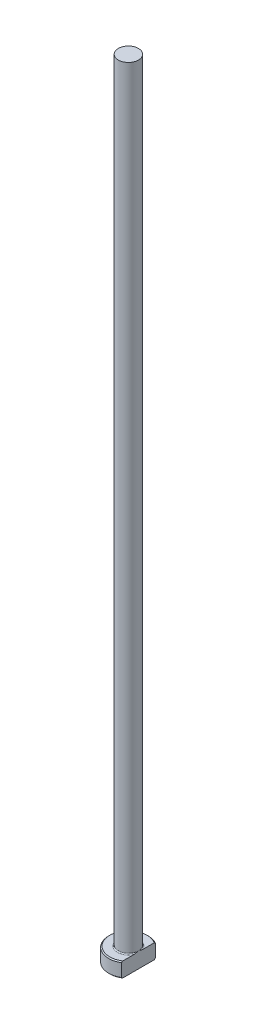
ISO-10303-21;
HEADER;
FILE_DESCRIPTION(('STEP AP214'),'2;1');
FILE_NAME('part.step','',(''),(''),'','','');
FILE_SCHEMA(('AUTOMOTIVE_DESIGN { 1 0 10303 214 1 1 1 1 }'));
ENDSEC;
DATA;
#1=APPLICATION_CONTEXT('core data for automotive mechanical design processes');
#2=APPLICATION_PROTOCOL_DEFINITION('international standard','automotive_design',2000,#1);
#3=PRODUCT_CONTEXT('',#1,'mechanical');
#4=PRODUCT('Part','Part','',(#3));
#5=PRODUCT_RELATED_PRODUCT_CATEGORY('part','',(#4));
#6=PRODUCT_DEFINITION_FORMATION('','',#4);
#7=PRODUCT_DEFINITION_CONTEXT('part definition',#1,'design');
#8=PRODUCT_DEFINITION('design','',#6,#7);
#9=PRODUCT_DEFINITION_SHAPE('','',#8);
#10=(LENGTH_UNIT() NAMED_UNIT(*) SI_UNIT(.MILLI.,.METRE.));
#11=(NAMED_UNIT(*) PLANE_ANGLE_UNIT() SI_UNIT($,.RADIAN.));
#12=(NAMED_UNIT(*) SI_UNIT($,.STERADIAN.) SOLID_ANGLE_UNIT());
#13=UNCERTAINTY_MEASURE_WITH_UNIT(LENGTH_MEASURE(1.E-05),#10,'distance_accuracy_value','');
#14=(GEOMETRIC_REPRESENTATION_CONTEXT(3) GLOBAL_UNCERTAINTY_ASSIGNED_CONTEXT((#13)) GLOBAL_UNIT_ASSIGNED_CONTEXT((#10,
#11,#12)) REPRESENTATION_CONTEXT('',''));
#15=CARTESIAN_POINT('',(0.,0.,0.));
#16=DIRECTION('',(0.,0.,1.));
#17=DIRECTION('',(1.,0.,0.));
#18=AXIS2_PLACEMENT_3D('',#15,#16,#17);
#19=CARTESIAN_POINT('',(0.,0.,0.));
#20=DIRECTION('',(0.,-1.,0.));
#21=DIRECTION('',(0.,0.,-1.));
#22=AXIS2_PLACEMENT_3D('',#19,#20,#21);
#23=PLANE('',#22);
#24=CARTESIAN_POINT('',(0.,0.,0.));
#25=DIRECTION('',(0.,-1.,0.));
#26=DIRECTION('',(0.,0.,-1.));
#27=AXIS2_PLACEMENT_3D('',#24,#25,#26);
#28=CIRCLE('',#27,3.79999999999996);
#29=CARTESIAN_POINT('',(2.04999999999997,0.,3.1996093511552));
#30=VERTEX_POINT('',#29);
#31=CARTESIAN_POINT('',(2.04999999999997,0.,-3.1996093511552));
#32=VERTEX_POINT('',#31);
#33=EDGE_CURVE('E98',#30,#32,#28,.T.);
#34=ORIENTED_EDGE('',*,*,#33,.T.);
#35=DIRECTION('',(0.,0.,1.));
#36=VECTOR('',#35,1.);
#37=CARTESIAN_POINT('',(2.04999999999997,0.,-3.4347488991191));
#38=LINE('',#37,#36);
#39=EDGE_CURVE('E83',#32,#30,#38,.T.);
#40=ORIENTED_EDGE('',*,*,#39,.T.);
#41=EDGE_LOOP('',(#34,#40));
#42=FACE_BOUND('',#41,.T.);
#43=ADVANCED_FACE('F32',(#42),#23,.T.);
#44=CARTESIAN_POINT('',(0.,259.958771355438,0.));
#45=DIRECTION('',(0.,1.,0.));
#46=DIRECTION('',(0.,0.,1.));
#47=AXIS2_PLACEMENT_3D('',#44,#45,#46);
#48=CYLINDRICAL_SURFACE('',#47,3.99999999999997);
#49=CARTESIAN_POINT('',(0.,2.79999999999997,0.));
#50=DIRECTION('',(0.,1.,0.));
#51=DIRECTION('',(0.,0.,1.));
#52=AXIS2_PLACEMENT_3D('',#49,#50,#51);
#53=CIRCLE('',#52,3.99999999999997);
#54=CARTESIAN_POINT('',(2.04999999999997,2.79999999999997,3.4347488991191));
#55=VERTEX_POINT('',#54);
#56=CARTESIAN_POINT('',(2.04999999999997,2.79999999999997,-3.4347488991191));
#57=VERTEX_POINT('',#56);
#58=EDGE_CURVE('E104',#55,#57,#53,.F.);
#59=ORIENTED_EDGE('',*,*,#58,.T.);
#60=DIRECTION('',(0.,-1.,0.));
#61=VECTOR('',#60,1.);
#62=CARTESIAN_POINT('',(2.04999999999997,160.,-3.4347488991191));
#63=LINE('',#62,#61);
#64=CARTESIAN_POINT('',(2.04999999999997,0.200000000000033,-3.4347488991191));
#65=VERTEX_POINT('',#64);
#66=EDGE_CURVE('E183',#57,#65,#63,.T.);
#67=ORIENTED_EDGE('',*,*,#66,.T.);
#68=CARTESIAN_POINT('',(0.,0.200000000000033,0.));
#69=DIRECTION('',(0.,-1.,0.));
#70=DIRECTION('',(0.,0.,-1.));
#71=AXIS2_PLACEMENT_3D('',#68,#69,#70);
#72=CIRCLE('',#71,3.99999999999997);
#73=CARTESIAN_POINT('',(2.04999999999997,0.200000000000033,3.4347488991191));
#74=VERTEX_POINT('',#73);
#75=EDGE_CURVE('E100',#65,#74,#72,.F.);
#76=ORIENTED_EDGE('',*,*,#75,.T.);
#77=DIRECTION('',(0.,-1.,0.));
#78=VECTOR('',#77,1.);
#79=CARTESIAN_POINT('',(2.04999999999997,160.,3.4347488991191));
#80=LINE('',#79,#78);
#81=EDGE_CURVE('E93',#55,#74,#80,.T.);
#82=ORIENTED_EDGE('',*,*,#81,.F.);
#83=EDGE_LOOP('',(#59,#67,#76,#82));
#84=FACE_BOUND('',#83,.T.);
#85=ADVANCED_FACE('F158',(#84),#48,.T.);
#86=CARTESIAN_POINT('',(-3.99999999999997,3.,0.));
#87=DIRECTION('',(0.,1.,0.));
#88=DIRECTION('',(0.,0.,1.));
#89=AXIS2_PLACEMENT_3D('',#86,#87,#88);
#90=PLANE('',#89);
#91=CARTESIAN_POINT('',(0.,3.,0.));
#92=DIRECTION('',(0.,1.,0.));
#93=DIRECTION('',(0.,0.,1.));
#94=AXIS2_PLACEMENT_3D('',#91,#92,#93);
#95=CIRCLE('',#94,3.79999999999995);
#96=CARTESIAN_POINT('',(2.04999999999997,3.,-3.19960935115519));
#97=VERTEX_POINT('',#96);
#98=CARTESIAN_POINT('',(2.04999999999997,3.,3.19960935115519));
#99=VERTEX_POINT('',#98);
#100=EDGE_CURVE('E178',#97,#99,#95,.T.);
#101=ORIENTED_EDGE('',*,*,#100,.T.);
#102=DIRECTION('',(0.,0.,-1.));
#103=VECTOR('',#102,1.);
#104=CARTESIAN_POINT('',(2.04999999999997,3.,0.));
#105=LINE('',#104,#103);
#106=CARTESIAN_POINT('',(2.04999999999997,2.99999999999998,0.927361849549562));
#107=VERTEX_POINT('',#106);
#108=EDGE_CURVE('E57',#99,#107,#105,.T.);
#109=ORIENTED_EDGE('',*,*,#108,.T.);
#110=CARTESIAN_POINT('',(0.,3.,0.));
#111=DIRECTION('',(0.,1.,0.));
#112=DIRECTION('',(0.,0.,1.));
#113=AXIS2_PLACEMENT_3D('',#110,#111,#112);
#114=CIRCLE('',#113,2.24999999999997);
#115=CARTESIAN_POINT('',(2.04999999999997,2.99999999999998,-0.927361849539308));
#116=VERTEX_POINT('',#115);
#117=EDGE_CURVE('E107',#107,#116,#114,.F.);
#118=ORIENTED_EDGE('',*,*,#117,.T.);
#119=EDGE_CURVE('E136',#116,#97,#105,.T.);
#120=ORIENTED_EDGE('',*,*,#119,.T.);
#121=EDGE_LOOP('',(#101,#109,#118,#120));
#122=FACE_BOUND('',#121,.T.);
#123=ADVANCED_FACE('F147',(#122),#90,.T.);
#124=CARTESIAN_POINT('',(0.,3.,0.));
#125=DIRECTION('',(0.,-1.,0.));
#126=DIRECTION('',(0.,0.,-1.));
#127=AXIS2_PLACEMENT_3D('',#124,#125,#126);
#128=CONICAL_SURFACE('',#127,3.79999999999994,0.785398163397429);
#129=ORIENTED_EDGE('',*,*,#58,.F.);
#130=CARTESIAN_POINT('',(2.04999999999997,-1.03146351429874,7.55839406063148));
#131=CARTESIAN_POINT('',(2.04999999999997,-0.873904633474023,7.39513453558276));
#132=CARTESIAN_POINT('',(2.04999999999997,-0.716518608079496,7.231707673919));
#133=CARTESIAN_POINT('',(2.04999999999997,-0.402187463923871,6.90442717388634));
#134=CARTESIAN_POINT('',(2.04999999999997,-0.245242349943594,6.74057353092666));
#135=CARTESIAN_POINT('',(2.04999999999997,0.0681734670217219,6.4122826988));
#136=CARTESIAN_POINT('',(2.04999999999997,0.224643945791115,6.24784529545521));
#137=CARTESIAN_POINT('',(2.04999999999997,0.536906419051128,5.91832867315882));
#138=CARTESIAN_POINT('',(2.04999999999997,0.692698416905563,5.75324945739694));
#139=CARTESIAN_POINT('',(2.04999999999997,1.00064251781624,5.42523572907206));
#140=CARTESIAN_POINT('',(2.04999999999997,1.15280992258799,5.26231559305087));
#141=CARTESIAN_POINT('',(2.04999999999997,1.45606307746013,4.93547204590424));
#142=CARTESIAN_POINT('',(2.04999999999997,1.60714883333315,4.77154864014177));
#143=CARTESIAN_POINT('',(2.04999999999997,1.90785570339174,4.4424154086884));
#144=CARTESIAN_POINT('',(2.04999999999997,2.05747707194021,4.27720581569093));
#145=CARTESIAN_POINT('',(2.04999999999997,2.35475209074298,3.94502824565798));
#146=CARTESIAN_POINT('',(2.04999999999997,2.50240579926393,3.77806032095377));
#147=CARTESIAN_POINT('',(2.04999999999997,2.74781587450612,3.4958333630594));
#148=CARTESIAN_POINT('',(2.04999999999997,2.84633082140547,3.38123477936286));
#149=CARTESIAN_POINT('',(2.04999999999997,3.04168132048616,3.15059166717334));
#150=CARTESIAN_POINT('',(2.04999999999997,3.13851670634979,3.03454699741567));
#151=CARTESIAN_POINT('',(2.04999999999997,3.33089134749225,2.79943466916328));
#152=CARTESIAN_POINT('',(2.04999999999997,3.42640790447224,2.68034837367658));
#153=CARTESIAN_POINT('',(2.04999999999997,3.61424509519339,2.43971344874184));
#154=CARTESIAN_POINT('',(2.04999999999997,3.70656652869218,2.31816544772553));
#155=CARTESIAN_POINT('',(2.04999999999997,3.88795970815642,2.06996820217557));
#156=CARTESIAN_POINT('',(2.04999999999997,3.97696605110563,1.94327085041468));
#157=CARTESIAN_POINT('',(2.04999999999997,4.14815278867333,1.6849964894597));
#158=CARTESIAN_POINT('',(2.04999999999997,4.2303237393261,1.55341308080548));
#159=CARTESIAN_POINT('',(2.04999999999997,4.34487781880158,1.35206756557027));
#160=CARTESIAN_POINT('',(2.04999999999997,4.3814245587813,1.28469323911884));
#161=CARTESIAN_POINT('',(2.04999999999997,4.45108462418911,1.14819983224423));
#162=CARTESIAN_POINT('',(2.04999999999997,4.48419730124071,1.07908042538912));
#163=CARTESIAN_POINT('',(2.04999999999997,4.57688716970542,0.869158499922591));
#164=CARTESIAN_POINT('',(2.04999999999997,4.63011331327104,0.725295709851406));
#165=CARTESIAN_POINT('',(2.04999999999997,4.68858147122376,0.509782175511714));
#166=CARTESIAN_POINT('',(2.04999999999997,4.70423178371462,0.440932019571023));
#167=CARTESIAN_POINT('',(2.04999999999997,4.7289937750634,0.302041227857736));
#168=CARTESIAN_POINT('',(2.04999999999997,4.73810615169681,0.232000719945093));
#169=CARTESIAN_POINT('',(2.04999999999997,4.7491421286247,0.0916144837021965));
#170=CARTESIAN_POINT('',(2.04999999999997,4.75109292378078,0.0212709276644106));
#171=CARTESIAN_POINT('',(2.04999999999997,4.74773665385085,-0.119244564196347));
#172=CARTESIAN_POINT('',(2.04999999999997,4.74242910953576,-0.189416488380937));
#173=CARTESIAN_POINT('',(2.04999999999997,4.72500657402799,-0.328355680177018));
#174=CARTESIAN_POINT('',(2.04999999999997,4.71294307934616,-0.397129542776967));
#175=CARTESIAN_POINT('',(2.04999999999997,4.68280191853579,-0.53333277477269));
#176=CARTESIAN_POINT('',(2.04999999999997,4.66472343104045,-0.600761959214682));
#177=CARTESIAN_POINT('',(2.04999999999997,4.62334379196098,-0.734440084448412));
#178=CARTESIAN_POINT('',(2.04999999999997,4.60001057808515,-0.800678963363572));
#179=CARTESIAN_POINT('',(2.04999999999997,4.54910792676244,-0.931471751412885));
#180=CARTESIAN_POINT('',(2.04999999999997,4.52153930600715,-0.996025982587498));
#181=CARTESIAN_POINT('',(2.04999999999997,4.43580994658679,-1.18273856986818));
#182=CARTESIAN_POINT('',(2.04999999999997,4.37300267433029,-1.30275656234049));
#183=CARTESIAN_POINT('',(2.04999999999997,4.23899016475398,-1.53805589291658));
#184=CARTESIAN_POINT('',(2.04999999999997,4.16777470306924,-1.65333122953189));
#185=CARTESIAN_POINT('',(2.04999999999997,4.01940383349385,-1.88059522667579));
#186=CARTESIAN_POINT('',(2.04999999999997,3.94222660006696,-1.9925695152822));
#187=CARTESIAN_POINT('',(2.04999999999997,3.78394545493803,-2.21359913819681));
#188=CARTESIAN_POINT('',(2.04999999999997,3.70284344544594,-2.3226558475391));
#189=CARTESIAN_POINT('',(2.04999999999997,3.53672600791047,-2.53996457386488));
#190=CARTESIAN_POINT('',(2.04999999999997,3.45167369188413,-2.64818825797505));
#191=CARTESIAN_POINT('',(2.04999999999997,3.27939927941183,-2.86290587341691));
#192=CARTESIAN_POINT('',(2.04999999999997,3.19217696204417,-2.96939962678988));
#193=CARTESIAN_POINT('',(2.04999999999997,3.01630213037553,-3.1807695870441));
#194=CARTESIAN_POINT('',(2.04999999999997,2.92765349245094,-3.28564902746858));
#195=CARTESIAN_POINT('',(2.04999999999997,2.74908778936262,-3.49432359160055));
#196=CARTESIAN_POINT('',(2.04999999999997,2.65917070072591,-3.5981186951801));
#197=CARTESIAN_POINT('',(2.04999999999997,2.42106477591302,-3.87030922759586));
#198=CARTESIAN_POINT('',(2.04999999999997,2.27204417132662,-4.03797649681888));
#199=CARTESIAN_POINT('',(2.04999999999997,1.97212991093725,-4.37162983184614));
#200=CARTESIAN_POINT('',(2.04999999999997,1.82123620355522,-4.53761585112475));
#201=CARTESIAN_POINT('',(2.04999999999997,1.51793530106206,-4.86847799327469));
#202=CARTESIAN_POINT('',(2.04999999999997,1.36552684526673,-5.03335295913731));
#203=CARTESIAN_POINT('',(2.04999999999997,1.0596711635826,-5.36213642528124));
#204=CARTESIAN_POINT('',(2.04999999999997,0.906223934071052,-5.52604492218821));
#205=CARTESIAN_POINT('',(2.04999999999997,0.604770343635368,-5.84646863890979));
#206=CARTESIAN_POINT('',(2.04999999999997,0.456795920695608,-6.003013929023));
#207=CARTESIAN_POINT('',(2.04999999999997,0.160257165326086,-6.31554566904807));
#208=CARTESIAN_POINT('',(2.04999999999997,0.0116928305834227,-6.47153211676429));
#209=CARTESIAN_POINT('',(2.04999999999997,-0.285748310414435,-6.78287905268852));
#210=CARTESIAN_POINT('',(2.04999999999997,-0.434624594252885,-6.93824004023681));
#211=CARTESIAN_POINT('',(2.04999999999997,-0.732769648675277,-7.24858246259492));
#212=CARTESIAN_POINT('',(2.04999999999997,-0.88203841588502,-7.40356390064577));
#213=CARTESIAN_POINT('',(2.04999999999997,-1.03146351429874,-7.55839406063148));
#214=B_SPLINE_CURVE_WITH_KNOTS('',3,(#130,#131,#132,#133,#134,#135,#136,#137,#138,#139,#140,
#141,#142,#143,#144,#145,#146,#147,#148,#149,#150,#151,#152,#153,#154,#155,#156,#157,#158,#159,
#160,#161,#162,#163,#164,#165,#166,#167,#168,#169,#170,#171,#172,#173,#174,#175,#176,#177,#178,
#179,#180,#181,#182,#183,#184,#185,#186,#187,#188,#189,#190,#191,#192,#193,#194,#195,#196,#197,
#198,#199,#200,#201,#202,#203,#204,#205,#206,#207,#208,#209,#210,#211,#212,#213),.UNSPECIFIED.,
.F.,.F.,(4,2,2,2,2,2,2,2,2,2,2,2,2,2,2,2,2,2,2,2,2,2,2,2,2,2,2,2,2,2,2,2,2,2,2,2,2,2,2,2,2,4),
(0.,0.680666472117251,1.36134029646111,2.04229694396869,2.72325021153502,3.39203729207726,
4.06082080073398,4.72948600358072,5.39813136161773,5.851487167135,6.30488761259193,
6.76282955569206,7.22065603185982,7.68503359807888,8.15004245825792,8.3798920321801,
8.60978492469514,9.06784199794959,9.27940643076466,9.49094828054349,9.70168600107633,
9.91243763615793,10.1216042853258,10.3307995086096,10.5413075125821,10.7517749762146,
11.1575695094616,11.5638626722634,11.9717209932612,12.3793835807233,12.7922829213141,
13.205224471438,13.6171880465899,14.0291592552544,14.7020968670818,15.3750530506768,
16.0486261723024,16.7222016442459,17.3684394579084,18.0146798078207,18.6602103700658,
19.3057354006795),.UNSPECIFIED.);
#215=EDGE_CURVE('E135',#55,#99,#214,.T.);
#216=ORIENTED_EDGE('',*,*,#215,.T.);
#217=ORIENTED_EDGE('',*,*,#100,.F.);
#218=EDGE_CURVE('E127',#97,#57,#214,.T.);
#219=ORIENTED_EDGE('',*,*,#218,.T.);
#220=EDGE_LOOP('',(#129,#216,#217,#219));
#221=FACE_BOUND('',#220,.T.);
#222=ADVANCED_FACE('F143',(#221),#128,.T.);
#223=CARTESIAN_POINT('',(0.,0.200000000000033,0.));
#224=DIRECTION('',(0.,1.,0.));
#225=DIRECTION('',(0.,0.,1.));
#226=AXIS2_PLACEMENT_3D('',#223,#224,#225);
#227=CONICAL_SURFACE('',#226,3.99999999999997,0.785398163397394);
#228=ORIENTED_EDGE('',*,*,#75,.F.);
#229=CARTESIAN_POINT('',(2.04999999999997,4.03146351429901,-7.55839406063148));
#230=CARTESIAN_POINT('',(2.04999999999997,3.87390463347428,-7.39513453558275));
#231=CARTESIAN_POINT('',(2.04999999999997,3.71651860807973,-7.23170767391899));
#232=CARTESIAN_POINT('',(2.04999999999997,3.40218746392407,-6.90442717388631));
#233=CARTESIAN_POINT('',(2.04999999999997,3.24524234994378,-6.74057353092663));
#234=CARTESIAN_POINT('',(2.04999999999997,2.93182653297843,-6.41228269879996));
#235=CARTESIAN_POINT('',(2.04999999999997,2.77535605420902,-6.24784529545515));
#236=CARTESIAN_POINT('',(2.04999999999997,2.46309358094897,-5.91832867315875));
#237=CARTESIAN_POINT('',(2.04999999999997,2.30730158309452,-5.75324945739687));
#238=CARTESIAN_POINT('',(2.04999999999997,1.9993574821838,-5.42523572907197));
#239=CARTESIAN_POINT('',(2.04999999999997,1.84719007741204,-5.26231559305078));
#240=CARTESIAN_POINT('',(2.04999999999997,1.54393692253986,-4.93547204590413));
#241=CARTESIAN_POINT('',(2.04999999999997,1.39285116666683,-4.77154864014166));
#242=CARTESIAN_POINT('',(2.04999999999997,1.09214429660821,-4.44241540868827));
#243=CARTESIAN_POINT('',(2.04999999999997,0.942522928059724,-4.27720581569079));
#244=CARTESIAN_POINT('',(2.04999999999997,0.645247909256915,-3.94502824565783));
#245=CARTESIAN_POINT('',(2.04999999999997,0.497594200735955,-3.77806032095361));
#246=CARTESIAN_POINT('',(2.04999999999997,0.252184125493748,-3.49583336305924));
#247=CARTESIAN_POINT('',(2.04999999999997,0.153669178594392,-3.3812347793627));
#248=CARTESIAN_POINT('',(2.04999999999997,-0.0416813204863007,-3.15059166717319));
#249=CARTESIAN_POINT('',(2.04999999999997,-0.138516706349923,-3.03454699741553));
#250=CARTESIAN_POINT('',(2.04999999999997,-0.330891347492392,-2.79943466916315));
#251=CARTESIAN_POINT('',(2.04999999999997,-0.42640790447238,-2.68034837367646));
#252=CARTESIAN_POINT('',(2.04999999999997,-0.614245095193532,-2.43971344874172));
#253=CARTESIAN_POINT('',(2.04999999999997,-0.706566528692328,-2.31816544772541));
#254=CARTESIAN_POINT('',(2.04999999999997,-0.887959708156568,-2.06996820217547));
#255=CARTESIAN_POINT('',(2.04999999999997,-0.97696605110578,-1.94327085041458));
#256=CARTESIAN_POINT('',(2.04999999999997,-1.14815278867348,-1.6849964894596));
#257=CARTESIAN_POINT('',(2.04999999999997,-1.23032373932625,-1.55341308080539));
#258=CARTESIAN_POINT('',(2.04999999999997,-1.34487781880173,-1.35206756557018));
#259=CARTESIAN_POINT('',(2.04999999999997,-1.38142455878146,-1.28469323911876));
#260=CARTESIAN_POINT('',(2.04999999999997,-1.45108462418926,-1.14819983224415));
#261=CARTESIAN_POINT('',(2.04999999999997,-1.48419730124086,-1.07908042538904));
#262=CARTESIAN_POINT('',(2.04999999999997,-1.57688716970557,-0.869158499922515));
#263=CARTESIAN_POINT('',(2.04999999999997,-1.63011331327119,-0.725295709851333));
#264=CARTESIAN_POINT('',(2.04999999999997,-1.6885814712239,-0.50978217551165));
#265=CARTESIAN_POINT('',(2.04999999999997,-1.70423178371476,-0.440932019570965));
#266=CARTESIAN_POINT('',(2.04999999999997,-1.72899377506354,-0.302041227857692));
#267=CARTESIAN_POINT('',(2.04999999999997,-1.73810615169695,-0.232000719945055));
#268=CARTESIAN_POINT('',(2.04999999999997,-1.74914212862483,-0.0916144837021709));
#269=CARTESIAN_POINT('',(2.04999999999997,-1.75109292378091,-0.0212709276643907));
#270=CARTESIAN_POINT('',(2.04999999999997,-1.74773665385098,0.119244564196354));
#271=CARTESIAN_POINT('',(2.04999999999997,-1.74242910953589,0.189416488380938));
#272=CARTESIAN_POINT('',(2.04999999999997,-1.72500657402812,0.328355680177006));
#273=CARTESIAN_POINT('',(2.04999999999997,-1.71294307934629,0.397129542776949));
#274=CARTESIAN_POINT('',(2.04999999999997,-1.68280191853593,0.53333277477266));
#275=CARTESIAN_POINT('',(2.04999999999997,-1.66472343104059,0.600761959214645));
#276=CARTESIAN_POINT('',(2.04999999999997,-1.62334379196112,0.734440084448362));
#277=CARTESIAN_POINT('',(2.04999999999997,-1.60001057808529,0.800678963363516));
#278=CARTESIAN_POINT('',(2.04999999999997,-1.54910792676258,0.931471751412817));
#279=CARTESIAN_POINT('',(2.04999999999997,-1.5215393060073,0.996025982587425));
#280=CARTESIAN_POINT('',(2.04999999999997,-1.43580994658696,1.18273856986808));
#281=CARTESIAN_POINT('',(2.04999999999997,-1.37300267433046,1.30275656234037));
#282=CARTESIAN_POINT('',(2.04999999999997,-1.23899016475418,1.53805589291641));
#283=CARTESIAN_POINT('',(2.04999999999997,-1.16777470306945,1.65333122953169));
#284=CARTESIAN_POINT('',(2.04999999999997,-1.01940383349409,1.88059522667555));
#285=CARTESIAN_POINT('',(2.04999999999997,-0.942226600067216,1.99256951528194));
#286=CARTESIAN_POINT('',(2.04999999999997,-0.783945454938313,2.21359913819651));
#287=CARTESIAN_POINT('',(2.04999999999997,-0.702843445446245,2.32265584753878));
#288=CARTESIAN_POINT('',(2.04999999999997,-0.536726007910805,2.53996457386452));
#289=CARTESIAN_POINT('',(2.04999999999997,-0.45167369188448,2.64818825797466));
#290=CARTESIAN_POINT('',(2.04999999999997,-0.279399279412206,2.86290587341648));
#291=CARTESIAN_POINT('',(2.04999999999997,-0.192176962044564,2.96939962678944));
#292=CARTESIAN_POINT('',(2.04999999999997,-0.0163021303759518,3.18076958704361));
#293=CARTESIAN_POINT('',(2.04999999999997,0.0723465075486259,3.28564902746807));
#294=CARTESIAN_POINT('',(2.04999999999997,0.250912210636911,3.4943235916));
#295=CARTESIAN_POINT('',(2.04999999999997,0.340829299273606,3.59811869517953));
#296=CARTESIAN_POINT('',(2.04999999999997,0.578935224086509,3.8703092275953));
#297=CARTESIAN_POINT('',(2.04999999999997,0.727955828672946,4.03797649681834));
#298=CARTESIAN_POINT('',(2.04999999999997,1.02787008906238,4.37162983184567));
#299=CARTESIAN_POINT('',(2.04999999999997,1.17876379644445,4.5376158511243));
#300=CARTESIAN_POINT('',(2.04999999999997,1.48206469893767,4.86847799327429));
#301=CARTESIAN_POINT('',(2.04999999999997,1.63447315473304,5.03335295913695));
#302=CARTESIAN_POINT('',(2.04999999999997,1.94032883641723,5.36213642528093));
#303=CARTESIAN_POINT('',(2.04999999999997,2.09377606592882,5.52604492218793));
#304=CARTESIAN_POINT('',(2.04999999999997,2.39522965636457,5.84646863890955));
#305=CARTESIAN_POINT('',(2.04999999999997,2.54320407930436,6.00301392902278));
#306=CARTESIAN_POINT('',(2.04999999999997,2.83974283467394,6.31554566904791));
#307=CARTESIAN_POINT('',(2.04999999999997,2.98830716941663,6.47153211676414));
#308=CARTESIAN_POINT('',(2.04999999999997,3.28574831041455,6.78287905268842));
#309=CARTESIAN_POINT('',(2.04999999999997,3.43462459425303,6.93824004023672));
#310=CARTESIAN_POINT('',(2.04999999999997,3.73276964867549,7.24858246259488));
#311=CARTESIAN_POINT('',(2.04999999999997,3.88203841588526,7.40356390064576));
#312=CARTESIAN_POINT('',(2.04999999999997,4.03146351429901,7.55839406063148));
#313=B_SPLINE_CURVE_WITH_KNOTS('',3,(#229,#230,#231,#232,#233,#234,#235,#236,#237,#238,#239,
#240,#241,#242,#243,#244,#245,#246,#247,#248,#249,#250,#251,#252,#253,#254,#255,#256,#257,#258,
#259,#260,#261,#262,#263,#264,#265,#266,#267,#268,#269,#270,#271,#272,#273,#274,#275,#276,#277,
#278,#279,#280,#281,#282,#283,#284,#285,#286,#287,#288,#289,#290,#291,#292,#293,#294,#295,#296,
#297,#298,#299,#300,#301,#302,#303,#304,#305,#306,#307,#308,#309,#310,#311,#312),.UNSPECIFIED.,
.F.,.F.,(4,2,2,2,2,2,2,2,2,2,2,2,2,2,2,2,2,2,2,2,2,2,2,2,2,2,2,2,2,2,2,2,2,2,2,2,2,2,2,2,2,4),
(0.,0.680666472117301,1.36134029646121,2.04229694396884,2.72325021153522,3.39203729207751,
4.06082080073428,4.72948600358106,5.39813136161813,5.85148716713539,6.3048876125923,
6.76282955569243,7.22065603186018,7.68503359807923,8.15004245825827,8.37989203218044,
8.60978492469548,9.06784199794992,9.27940643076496,9.49094828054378,9.7016860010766,
9.91243763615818,10.1216042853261,10.3307995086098,10.5413075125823,10.7517749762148,
11.1575695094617,11.5638626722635,11.9717209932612,12.3793835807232,12.7922829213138,
13.2052244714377,13.6171880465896,14.0291592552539,14.7020968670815,15.3750530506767,
16.0486261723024,16.7222016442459,17.3684394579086,18.014679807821,18.6602103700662,
19.30573540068),.UNSPECIFIED.);
#314=EDGE_CURVE('E86',#65,#32,#313,.T.);
#315=ORIENTED_EDGE('',*,*,#314,.T.);
#316=ORIENTED_EDGE('',*,*,#33,.F.);
#317=EDGE_CURVE('E89',#30,#74,#313,.T.);
#318=ORIENTED_EDGE('',*,*,#317,.T.);
#319=EDGE_LOOP('',(#228,#315,#316,#318));
#320=FACE_BOUND('',#319,.T.);
#321=ADVANCED_FACE('F97',(#320),#227,.T.);
#322=CARTESIAN_POINT('',(0.,3.19999999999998,0.));
#323=DIRECTION('',(0.,1.,0.));
#324=DIRECTION('',(0.,0.,1.));
#325=AXIS2_PLACEMENT_3D('',#322,#323,#324);
#326=TOROIDAL_SURFACE('',#325,2.24999999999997,0.2);
#327=CARTESIAN_POINT('',(2.04999999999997,3.19999999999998,0.));
#328=CARTESIAN_POINT('',(2.04999999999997,3.20000050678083,1.11433978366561E-10));
#329=CARTESIAN_POINT('',(2.04999999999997,3.20000101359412,-1.49199173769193E-07));
#330=CARTESIAN_POINT('',(2.04999999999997,3.20000197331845,-5.90092849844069E-07));
#331=CARTESIAN_POINT('',(2.04999999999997,3.20000242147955,-8.89334890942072E-07));
#332=CARTESIAN_POINT('',(2.04999999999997,3.200003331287,-1.60386249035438E-06));
#333=CARTESIAN_POINT('',(2.04999999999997,3.20000378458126,-2.02988262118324E-06));
#334=CARTESIAN_POINT('',(2.04999999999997,3.20000461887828,-2.92958555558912E-06));
#335=CARTESIAN_POINT('',(2.04999999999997,3.20000500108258,-3.40221864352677E-06));
#336=CARTESIAN_POINT('',(2.04999999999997,3.20000635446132,-5.1677876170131E-06));
#337=CARTESIAN_POINT('',(2.04999999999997,3.20000725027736,-6.52020726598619E-06));
#338=CARTESIAN_POINT('',(2.04999999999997,3.20000878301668,-9.25136186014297E-06));
#339=CARTESIAN_POINT('',(2.04999999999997,3.20000943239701,-1.06234618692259E-05));
#340=CARTESIAN_POINT('',(2.04999999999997,3.20001203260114,-1.6232674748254E-05));
#341=CARTESIAN_POINT('',(2.04999999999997,3.20001389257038,-2.05163580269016E-05));
#342=CARTESIAN_POINT('',(2.04999999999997,3.20001674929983,-2.87532844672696E-05));
#343=CARTESIAN_POINT('',(2.04999999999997,3.20001782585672,-3.2679073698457E-05));
#344=CARTESIAN_POINT('',(2.04999999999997,3.20002546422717,-6.12436551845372E-05));
#345=CARTESIAN_POINT('',(2.04999999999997,3.20003105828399,-8.60941961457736E-05));
#346=CARTESIAN_POINT('',(2.04999999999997,3.20005552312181,-0.000183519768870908));
#347=CARTESIAN_POINT('',(2.04999999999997,3.20007904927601,-0.000254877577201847));
#348=CARTESIAN_POINT('',(2.04999999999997,3.20016988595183,-0.000535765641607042));
#349=CARTESIAN_POINT('',(2.04999999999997,3.20023402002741,-0.000746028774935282));
#350=CARTESIAN_POINT('',(2.04999999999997,3.20048927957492,-0.0015758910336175));
#351=CARTESIAN_POINT('',(2.04999999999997,3.20068429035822,-0.00219457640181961));
#352=CARTESIAN_POINT('',(2.04999999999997,3.20148922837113,-0.00475596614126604));
#353=CARTESIAN_POINT('',(2.04999999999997,3.20209434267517,-0.0066998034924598));
#354=CARTESIAN_POINT('',(2.04999999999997,3.20817248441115,-0.026215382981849));
#355=CARTESIAN_POINT('',(2.04999999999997,3.21366777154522,-0.0437820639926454));
#356=CARTESIAN_POINT('',(2.04999999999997,3.22440004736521,-0.0782469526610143));
#357=CARTESIAN_POINT('',(2.04999999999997,3.22963878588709,-0.0951446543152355));
#358=CARTESIAN_POINT('',(2.04999999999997,3.24070596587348,-0.13103721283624));
#359=CARTESIAN_POINT('',(2.04999999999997,3.24652762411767,-0.150034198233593));
#360=CARTESIAN_POINT('',(2.04999999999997,3.25812563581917,-0.188263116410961));
#361=CARTESIAN_POINT('',(2.04999999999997,3.26390084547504,-0.207495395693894));
#362=CARTESIAN_POINT('',(2.04999999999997,3.27784177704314,-0.254568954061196));
#363=CARTESIAN_POINT('',(2.04999999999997,3.28592802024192,-0.282433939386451));
#364=CARTESIAN_POINT('',(2.04999999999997,3.30147824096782,-0.337598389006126));
#365=CARTESIAN_POINT('',(2.04999999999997,3.30895263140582,-0.364894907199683));
#366=CARTESIAN_POINT('',(2.04999999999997,3.32487272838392,-0.425333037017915));
#367=CARTESIAN_POINT('',(2.04999999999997,3.33319621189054,-0.458507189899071));
#368=CARTESIAN_POINT('',(2.04999999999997,3.34887938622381,-0.525344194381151));
#369=CARTESIAN_POINT('',(2.04999999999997,3.35623148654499,-0.559008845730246));
#370=CARTESIAN_POINT('',(2.04999999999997,3.3700913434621,-0.629073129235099));
#371=CARTESIAN_POINT('',(2.04999999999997,3.37649834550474,-0.665493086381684));
#372=CARTESIAN_POINT('',(2.04999999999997,3.38732437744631,-0.738624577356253));
#373=CARTESIAN_POINT('',(2.04999999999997,3.39174404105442,-0.775336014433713));
#374=CARTESIAN_POINT('',(2.04999999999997,3.39842323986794,-0.853869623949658));
#375=CARTESIAN_POINT('',(2.04999999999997,3.40031921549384,-0.895724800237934));
#376=CARTESIAN_POINT('',(2.04999999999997,3.3995967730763,-0.978802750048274));
#377=CARTESIAN_POINT('',(2.04999999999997,3.39705088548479,-1.02002480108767));
#378=CARTESIAN_POINT('',(2.04999999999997,3.38815866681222,-1.08355885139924));
#379=CARTESIAN_POINT('',(2.04999999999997,3.38399133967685,-1.10617047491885));
#380=CARTESIAN_POINT('',(2.04999999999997,3.37312056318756,-1.1508734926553));
#381=CARTESIAN_POINT('',(2.04999999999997,3.36641150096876,-1.17296361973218));
#382=CARTESIAN_POINT('',(2.04999999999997,3.35241630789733,-1.20879754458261));
#383=CARTESIAN_POINT('',(2.04999999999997,3.34604663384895,-1.22289572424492));
#384=CARTESIAN_POINT('',(2.04999999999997,3.33145856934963,-1.25010305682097));
#385=CARTESIAN_POINT('',(2.04999999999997,3.32324484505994,-1.26321459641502));
#386=CARTESIAN_POINT('',(2.04999999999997,3.30807074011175,-1.28311183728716));
#387=CARTESIAN_POINT('',(2.04999999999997,3.30180162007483,-1.29042146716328));
#388=CARTESIAN_POINT('',(2.04999999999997,3.28827985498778,-1.30407693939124));
#389=CARTESIAN_POINT('',(2.04999999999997,3.28102850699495,-1.31042402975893));
#390=CARTESIAN_POINT('',(2.04999999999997,3.26730073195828,-1.32042781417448));
#391=CARTESIAN_POINT('',(2.04999999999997,3.26103227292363,-1.32436729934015));
#392=CARTESIAN_POINT('',(2.04999999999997,3.24793774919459,-1.33118589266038));
#393=CARTESIAN_POINT('',(2.04999999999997,3.2411121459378,-1.3340658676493));
#394=CARTESIAN_POINT('',(2.04999999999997,3.22696550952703,-1.33854399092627));
#395=CARTESIAN_POINT('',(2.04999999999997,3.21964010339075,-1.34012865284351));
#396=CARTESIAN_POINT('',(2.04999999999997,3.20482104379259,-1.34178557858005));
#397=CARTESIAN_POINT('',(2.04999999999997,3.19732755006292,-1.34185922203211));
#398=CARTESIAN_POINT('',(2.04999999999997,3.18362821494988,-1.34059674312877));
#399=CARTESIAN_POINT('',(2.04999999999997,3.17740126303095,-1.3394752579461));
#400=CARTESIAN_POINT('',(2.04999999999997,3.16521180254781,-1.33624238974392));
#401=CARTESIAN_POINT('',(2.04999999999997,3.15924940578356,-1.33413059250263));
#402=CARTESIAN_POINT('',(2.04999999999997,3.14588128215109,-1.32826056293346));
#403=CARTESIAN_POINT('',(2.04999999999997,3.13861186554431,-1.324193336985));
#404=CARTESIAN_POINT('',(2.04999999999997,3.1248230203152,-1.314942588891));
#405=CARTESIAN_POINT('',(2.04999999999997,3.11830521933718,-1.30975671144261));
#406=CARTESIAN_POINT('',(2.04999999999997,3.10285879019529,-1.29569016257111));
#407=CARTESIAN_POINT('',(2.04999999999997,3.09441467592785,-1.28628110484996));
#408=CARTESIAN_POINT('',(2.04999999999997,3.07905572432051,-1.26631405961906));
#409=CARTESIAN_POINT('',(2.04999999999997,3.07214294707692,-1.25575455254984));
#410=CARTESIAN_POINT('',(2.04999999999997,3.05475343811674,-1.22547453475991));
#411=CARTESIAN_POINT('',(2.04999999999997,3.04564540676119,-1.20497519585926));
#412=CARTESIAN_POINT('',(2.04999999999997,3.03036658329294,-1.16279344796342));
#413=CARTESIAN_POINT('',(2.04999999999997,3.02422151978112,-1.14110243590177));
#414=CARTESIAN_POINT('',(2.04999999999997,3.01411308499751,-1.09654657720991));
#415=CARTESIAN_POINT('',(2.04999999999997,3.01022074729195,-1.07366604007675));
#416=CARTESIAN_POINT('',(2.04999999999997,3.00438595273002,-1.02762855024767));
#417=CARTESIAN_POINT('',(2.04999999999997,3.00244735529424,-1.00447114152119));
#418=CARTESIAN_POINT('',(2.04999999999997,2.99907945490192,-0.936481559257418));
#419=CARTESIAN_POINT('',(2.04999999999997,2.99980550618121,-0.891546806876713));
#420=CARTESIAN_POINT('',(2.04999999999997,3.00639312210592,-0.785106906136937));
#421=CARTESIAN_POINT('',(2.04999999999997,3.01408723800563,-0.723739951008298));
#422=CARTESIAN_POINT('',(2.04999999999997,3.03471721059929,-0.600423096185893));
#423=CARTESIAN_POINT('',(2.04999999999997,3.04777621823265,-0.538495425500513));
#424=CARTESIAN_POINT('',(2.04999999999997,3.07250330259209,-0.435218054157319));
#425=CARTESIAN_POINT('',(2.04999999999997,3.08327201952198,-0.393644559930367));
#426=CARTESIAN_POINT('',(2.04999999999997,3.1057691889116,-0.311244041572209));
#427=CARTESIAN_POINT('',(2.04999999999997,3.117485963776,-0.270413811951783));
#428=CARTESIAN_POINT('',(2.04999999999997,3.14023315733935,-0.193479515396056));
#429=CARTESIAN_POINT('',(2.04999999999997,3.15119500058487,-0.157354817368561));
#430=CARTESIAN_POINT('',(2.04999999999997,3.17387809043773,-0.083701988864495));
#431=CARTESIAN_POINT('',(2.04999999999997,3.18561198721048,-0.0461776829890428));
#432=CARTESIAN_POINT('',(2.04999999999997,3.19790660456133,-0.00669647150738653));
#433=CARTESIAN_POINT('',(2.04999999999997,3.19851281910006,-0.00474933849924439));
#434=CARTESIAN_POINT('',(2.04999999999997,3.19931801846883,-0.00218718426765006));
#435=CARTESIAN_POINT('',(2.04999999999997,3.19951222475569,-0.00157103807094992));
#436=CARTESIAN_POINT('',(2.04999999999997,3.1997665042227,-0.000744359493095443));
#437=CARTESIAN_POINT('',(2.04999999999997,3.1998304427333,-0.000534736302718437));
#438=CARTESIAN_POINT('',(2.04999999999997,3.19992104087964,-0.000254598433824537));
#439=CARTESIAN_POINT('',(2.04999999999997,3.19994453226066,-0.000183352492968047));
#440=CARTESIAN_POINT('',(2.04999999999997,3.19996896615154,-8.60574042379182E-05));
#441=CARTESIAN_POINT('',(2.04999999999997,3.19997455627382,-6.12234779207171E-05));
#442=CARTESIAN_POINT('',(2.04999999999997,3.19998218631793,-3.26756404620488E-05));
#443=CARTESIAN_POINT('',(2.04999999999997,3.19998326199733,-2.87508616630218E-05));
#444=CARTESIAN_POINT('',(2.04999999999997,3.19998611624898,-2.05159271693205E-05));
#445=CARTESIAN_POINT('',(2.04999999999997,3.19998797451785,-1.62331737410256E-05));
#446=CARTESIAN_POINT('',(2.04999999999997,3.19999057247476,-1.06248953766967E-05));
#447=CARTESIAN_POINT('',(2.04999999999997,3.19999122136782,-9.25287084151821E-06));
#448=CARTESIAN_POINT('',(2.04999999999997,3.19999275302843,-6.52177957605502E-06));
#449=CARTESIAN_POINT('',(2.04999999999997,3.19999364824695,-5.16933999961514E-06));
#450=CARTESIAN_POINT('',(2.04999999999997,3.19999500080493,-3.40363971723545E-06));
#451=CARTESIAN_POINT('',(2.04999999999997,3.19999538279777,-2.93094612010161E-06));
#452=CARTESIAN_POINT('',(2.04999999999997,3.19999621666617,-2.03108406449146E-06));
#453=CARTESIAN_POINT('',(2.04999999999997,3.19999666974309,-1.60496444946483E-06));
#454=CARTESIAN_POINT('',(2.04999999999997,3.19999757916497,-8.90199500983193E-07));
#455=CARTESIAN_POINT('',(2.04999999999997,3.19999802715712,-5.90826803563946E-07));
#456=CARTESIAN_POINT('',(2.04999999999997,3.19999898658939,-1.49609897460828E-07));
#457=CARTESIAN_POINT('',(2.04999999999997,3.19999949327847,-1.11420931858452E-10));
#458=CARTESIAN_POINT('',(2.04999999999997,3.19999999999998,0.));
#459=B_SPLINE_CURVE_WITH_KNOTS('',3,(#327,#328,#329,#330,#331,#332,#333,#334,#335,#336,#337,
#338,#339,#340,#341,#342,#343,#344,#345,#346,#347,#348,#349,#350,#351,#352,#353,#354,#355,#356,
#357,#358,#359,#360,#361,#362,#363,#364,#365,#366,#367,#368,#369,#370,#371,#372,#373,#374,#375,
#376,#377,#378,#379,#380,#381,#382,#383,#384,#385,#386,#387,#388,#389,#390,#391,#392,#393,#394,
#395,#396,#397,#398,#399,#400,#401,#402,#403,#404,#405,#406,#407,#408,#409,#410,#411,#412,#413,
#414,#415,#416,#417,#418,#419,#420,#421,#422,#423,#424,#425,#426,#427,#428,#429,#430,#431,#432,
#433,#434,#435,#436,#437,#438,#439,#440,#441,#442,#443,#444,#445,#446,#447,#448,#449,#450,#451,
#452,#453,#454,#455,#456,#457,#458),.UNSPECIFIED.,.T.,.F.,(4,2,2,2,2,2,2,2,2,2,2,2,2,2,2,2,2,2,
2,2,2,2,2,2,2,2,2,2,2,2,2,2,2,2,2,2,2,2,2,2,2,2,2,2,2,2,2,2,2,2,2,2,2,2,2,2,2,2,2,2,2,2,2,2,2,
4),(0.,1.52408153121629E-06,3.13545629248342E-06,4.99238279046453E-06,6.81430914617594E-06,
1.16602223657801E-05,1.62106020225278E-05,3.01878492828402E-05,4.23839441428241E-05,
0.000118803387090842,0.000343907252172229,0.00100368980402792,0.0029493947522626,
0.00905734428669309,0.0642734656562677,0.117347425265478,0.176954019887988,0.237195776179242,
0.324236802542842,0.409137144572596,0.511731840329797,0.615085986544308,0.725981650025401,
0.836841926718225,0.962382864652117,1.08589300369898,1.15477424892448,1.22380849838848,
1.27012487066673,1.31632533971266,1.34514229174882,1.37392155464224,1.3960524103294,
1.41816511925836,1.44050522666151,1.46282493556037,1.48171899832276,1.50062097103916,
1.52547167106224,1.55037521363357,1.58808905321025,1.62585332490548,1.69277250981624,
1.76026275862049,1.82977909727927,1.89943249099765,2.03394841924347,2.21916675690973,
2.40889807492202,2.5377192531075,2.66514307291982,2.77839635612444,2.89633906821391,
2.90245742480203,2.90439514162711,2.9050529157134,2.90527766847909,2.90535403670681,
2.90536622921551,2.905380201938,2.90538475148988,2.90538959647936,2.90539141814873,
2.90539327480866,2.9053948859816,2.90539640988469),.UNSPECIFIED.);
#460=CARTESIAN_POINT('',(2.04999999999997,3.19999999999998,0.));
#461=VERTEX_POINT('',#460);
#462=EDGE_CURVE('E11',#116,#461,#459,.T.);
#463=ORIENTED_EDGE('',*,*,#462,.F.);
#464=ORIENTED_EDGE('',*,*,#117,.F.);
#465=CARTESIAN_POINT('',(2.04999999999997,3.19999999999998,0.));
#466=CARTESIAN_POINT('',(2.04999999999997,3.19999949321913,-1.11434018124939E-10));
#467=CARTESIAN_POINT('',(2.04999999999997,3.19999898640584,1.49199173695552E-07));
#468=CARTESIAN_POINT('',(2.04999999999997,3.19999802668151,5.90092849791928E-07));
#469=CARTESIAN_POINT('',(2.04999999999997,3.19999757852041,8.89334890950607E-07));
#470=CARTESIAN_POINT('',(2.04999999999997,3.19999666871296,1.603862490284E-06));
#471=CARTESIAN_POINT('',(2.04999999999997,3.1999962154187,2.02988262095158E-06));
#472=CARTESIAN_POINT('',(2.04999999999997,3.19999538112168,2.92958555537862E-06));
#473=CARTESIAN_POINT('',(2.04999999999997,3.19999499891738,3.40221864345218E-06));
#474=CARTESIAN_POINT('',(2.04999999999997,3.19999364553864,5.16778761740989E-06));
#475=CARTESIAN_POINT('',(2.04999999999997,3.1999927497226,6.52020726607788E-06));
#476=CARTESIAN_POINT('',(2.04999999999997,3.19999121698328,9.25136186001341E-06));
#477=CARTESIAN_POINT('',(2.04999999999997,3.19999056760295,1.06234618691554E-05));
#478=CARTESIAN_POINT('',(2.04999999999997,3.19998796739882,1.62326747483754E-05));
#479=CARTESIAN_POINT('',(2.04999999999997,3.19998610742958,2.05163580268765E-05));
#480=CARTESIAN_POINT('',(2.04999999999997,3.19998325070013,2.8753284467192E-05));
#481=CARTESIAN_POINT('',(2.04999999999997,3.19998217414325,3.26790736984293E-05));
#482=CARTESIAN_POINT('',(2.04999999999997,3.19997453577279,6.12436551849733E-05));
#483=CARTESIAN_POINT('',(2.04999999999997,3.19996894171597,8.60941961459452E-05));
#484=CARTESIAN_POINT('',(2.04999999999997,3.19994447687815,0.000183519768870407));
#485=CARTESIAN_POINT('',(2.04999999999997,3.19992095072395,0.00025487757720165));
#486=CARTESIAN_POINT('',(2.04999999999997,3.19983011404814,0.000535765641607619));
#487=CARTESIAN_POINT('',(2.04999999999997,3.19976597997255,0.000746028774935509));
#488=CARTESIAN_POINT('',(2.04999999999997,3.19951072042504,0.00157589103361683));
#489=CARTESIAN_POINT('',(2.04999999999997,3.19931570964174,0.00219457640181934));
#490=CARTESIAN_POINT('',(2.04999999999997,3.19851077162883,0.00475596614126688));
#491=CARTESIAN_POINT('',(2.04999999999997,3.19790565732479,0.00669980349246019));
#492=CARTESIAN_POINT('',(2.04999999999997,3.1918275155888,0.0262153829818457));
#493=CARTESIAN_POINT('',(2.04999999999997,3.18633222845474,0.0437820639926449));
#494=CARTESIAN_POINT('',(2.04999999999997,3.17559995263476,0.0782469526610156));
#495=CARTESIAN_POINT('',(2.04999999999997,3.17036121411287,0.0951446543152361));
#496=CARTESIAN_POINT('',(2.04999999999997,3.15929403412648,0.13103721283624));
#497=CARTESIAN_POINT('',(2.04999999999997,3.15347237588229,0.150034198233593));
#498=CARTESIAN_POINT('',(2.04999999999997,3.14187436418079,0.188263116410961));
#499=CARTESIAN_POINT('',(2.04999999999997,3.13609915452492,0.207495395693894));
#500=CARTESIAN_POINT('',(2.04999999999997,3.12215822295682,0.254568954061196));
#501=CARTESIAN_POINT('',(2.04999999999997,3.11407197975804,0.282433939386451));
#502=CARTESIAN_POINT('',(2.04999999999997,3.09852175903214,0.337598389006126));
#503=CARTESIAN_POINT('',(2.04999999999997,3.09104736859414,0.364894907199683));
#504=CARTESIAN_POINT('',(2.04999999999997,3.07512727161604,0.425333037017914));
#505=CARTESIAN_POINT('',(2.04999999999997,3.06680378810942,0.458507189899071));
#506=CARTESIAN_POINT('',(2.04999999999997,3.05112061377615,0.525344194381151));
#507=CARTESIAN_POINT('',(2.04999999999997,3.04376851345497,0.559008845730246));
#508=CARTESIAN_POINT('',(2.04999999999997,3.02990865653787,0.629073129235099));
#509=CARTESIAN_POINT('',(2.04999999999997,3.02350165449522,0.665493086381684));
#510=CARTESIAN_POINT('',(2.04999999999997,3.01267562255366,0.738624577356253));
#511=CARTESIAN_POINT('',(2.04999999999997,3.00825595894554,0.775336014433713));
#512=CARTESIAN_POINT('',(2.04999999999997,3.00157676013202,0.853869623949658));
#513=CARTESIAN_POINT('',(2.04999999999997,2.99968078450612,0.895724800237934));
#514=CARTESIAN_POINT('',(2.04999999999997,3.00040322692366,0.978802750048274));
#515=CARTESIAN_POINT('',(2.04999999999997,3.00294911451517,1.02002480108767));
#516=CARTESIAN_POINT('',(2.04999999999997,3.01184133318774,1.08355885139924));
#517=CARTESIAN_POINT('',(2.04999999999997,3.01600866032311,1.10617047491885));
#518=CARTESIAN_POINT('',(2.04999999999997,3.0268794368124,1.1508734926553));
#519=CARTESIAN_POINT('',(2.04999999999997,3.0335884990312,1.17296361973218));
#520=CARTESIAN_POINT('',(2.04999999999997,3.04758369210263,1.20879754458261));
#521=CARTESIAN_POINT('',(2.04999999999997,3.05395336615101,1.22289572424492));
#522=CARTESIAN_POINT('',(2.04999999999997,3.06854143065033,1.25010305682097));
#523=CARTESIAN_POINT('',(2.04999999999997,3.07675515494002,1.26321459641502));
#524=CARTESIAN_POINT('',(2.04999999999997,3.09192925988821,1.28311183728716));
#525=CARTESIAN_POINT('',(2.04999999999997,3.09819837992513,1.29042146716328));
#526=CARTESIAN_POINT('',(2.04999999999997,3.11172014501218,1.30407693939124));
#527=CARTESIAN_POINT('',(2.04999999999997,3.11897149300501,1.31042402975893));
#528=CARTESIAN_POINT('',(2.04999999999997,3.13269926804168,1.32042781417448));
#529=CARTESIAN_POINT('',(2.04999999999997,3.13896772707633,1.32436729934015));
#530=CARTESIAN_POINT('',(2.04999999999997,3.15206225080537,1.33118589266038));
#531=CARTESIAN_POINT('',(2.04999999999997,3.15888785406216,1.3340658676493));
#532=CARTESIAN_POINT('',(2.04999999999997,3.17303449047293,1.33854399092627));
#533=CARTESIAN_POINT('',(2.04999999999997,3.18035989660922,1.34012865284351));
#534=CARTESIAN_POINT('',(2.04999999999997,3.19517895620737,1.34178557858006));
#535=CARTESIAN_POINT('',(2.04999999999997,3.20267244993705,1.34185922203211));
#536=CARTESIAN_POINT('',(2.04999999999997,3.21637178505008,1.34059674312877));
#537=CARTESIAN_POINT('',(2.04999999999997,3.22259873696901,1.3394752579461));
#538=CARTESIAN_POINT('',(2.04999999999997,3.23478819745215,1.33624238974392));
#539=CARTESIAN_POINT('',(2.04999999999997,3.2407505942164,1.33413059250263));
#540=CARTESIAN_POINT('',(2.04999999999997,3.25411871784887,1.32826056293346));
#541=CARTESIAN_POINT('',(2.04999999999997,3.26138813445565,1.324193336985));
#542=CARTESIAN_POINT('',(2.04999999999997,3.27517697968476,1.314942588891));
#543=CARTESIAN_POINT('',(2.04999999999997,3.28169478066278,1.30975671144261));
#544=CARTESIAN_POINT('',(2.04999999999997,3.29714120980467,1.29569016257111));
#545=CARTESIAN_POINT('',(2.04999999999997,3.30558532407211,1.28628110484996));
#546=CARTESIAN_POINT('',(2.04999999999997,3.32094427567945,1.26631405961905));
#547=CARTESIAN_POINT('',(2.04999999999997,3.32785705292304,1.25575455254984));
#548=CARTESIAN_POINT('',(2.04999999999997,3.34524656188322,1.22547453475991));
#549=CARTESIAN_POINT('',(2.04999999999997,3.35435459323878,1.20497519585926));
#550=CARTESIAN_POINT('',(2.04999999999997,3.36963341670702,1.16279344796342));
#551=CARTESIAN_POINT('',(2.04999999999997,3.37577848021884,1.14110243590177));
#552=CARTESIAN_POINT('',(2.04999999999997,3.38588691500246,1.09654657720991));
#553=CARTESIAN_POINT('',(2.04999999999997,3.38977925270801,1.07366604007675));
#554=CARTESIAN_POINT('',(2.04999999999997,3.39561404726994,1.02762855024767));
#555=CARTESIAN_POINT('',(2.04999999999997,3.39755264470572,1.00447114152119));
#556=CARTESIAN_POINT('',(2.04999999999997,3.40092054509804,0.936481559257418));
#557=CARTESIAN_POINT('',(2.04999999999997,3.40019449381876,0.891546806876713));
#558=CARTESIAN_POINT('',(2.04999999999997,3.39360687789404,0.785106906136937));
#559=CARTESIAN_POINT('',(2.04999999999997,3.38591276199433,0.723739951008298));
#560=CARTESIAN_POINT('',(2.04999999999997,3.36528278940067,0.600423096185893));
#561=CARTESIAN_POINT('',(2.04999999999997,3.35222378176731,0.538495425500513));
#562=CARTESIAN_POINT('',(2.04999999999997,3.32749669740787,0.435218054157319));
#563=CARTESIAN_POINT('',(2.04999999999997,3.31672798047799,0.393644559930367));
#564=CARTESIAN_POINT('',(2.04999999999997,3.29423081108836,0.311244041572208));
#565=CARTESIAN_POINT('',(2.04999999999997,3.28251403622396,0.270413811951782));
#566=CARTESIAN_POINT('',(2.04999999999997,3.25976684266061,0.193479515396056));
#567=CARTESIAN_POINT('',(2.04999999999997,3.24880499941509,0.157354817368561));
#568=CARTESIAN_POINT('',(2.04999999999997,3.22612190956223,0.0837019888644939));
#569=CARTESIAN_POINT('',(2.04999999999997,3.2143880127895,0.0461776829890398));
#570=CARTESIAN_POINT('',(2.04999999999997,3.20209339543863,0.00669647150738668));
#571=CARTESIAN_POINT('',(2.04999999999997,3.2014871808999,0.0047493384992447));
#572=CARTESIAN_POINT('',(2.04999999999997,3.20068198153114,0.00218718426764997));
#573=CARTESIAN_POINT('',(2.04999999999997,3.20048777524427,0.00157103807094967));
#574=CARTESIAN_POINT('',(2.04999999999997,3.20023349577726,0.000744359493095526));
#575=CARTESIAN_POINT('',(2.04999999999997,3.20016955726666,0.000534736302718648));
#576=CARTESIAN_POINT('',(2.04999999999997,3.20007895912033,0.000254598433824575));
#577=CARTESIAN_POINT('',(2.04999999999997,3.20005546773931,0.000183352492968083));
#578=CARTESIAN_POINT('',(2.04999999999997,3.20003103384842,8.60574042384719E-05));
#579=CARTESIAN_POINT('',(2.04999999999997,3.20002544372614,6.12234779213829E-05));
#580=CARTESIAN_POINT('',(2.04999999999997,3.20001781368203,3.26756404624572E-05));
#581=CARTESIAN_POINT('',(2.04999999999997,3.20001673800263,2.87508616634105E-05));
#582=CARTESIAN_POINT('',(2.04999999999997,3.20001388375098,2.05159271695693E-05));
#583=CARTESIAN_POINT('',(2.04999999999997,3.20001202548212,1.62331737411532E-05));
#584=CARTESIAN_POINT('',(2.04999999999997,3.2000094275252,1.06248953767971E-05));
#585=CARTESIAN_POINT('',(2.04999999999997,3.20000877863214,9.25287084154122E-06));
#586=CARTESIAN_POINT('',(2.04999999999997,3.20000724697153,6.52177957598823E-06));
#587=CARTESIAN_POINT('',(2.04999999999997,3.20000635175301,5.1693399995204E-06));
#588=CARTESIAN_POINT('',(2.04999999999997,3.20000499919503,3.40363971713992E-06));
#589=CARTESIAN_POINT('',(2.04999999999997,3.20000461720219,2.93094612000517E-06));
#590=CARTESIAN_POINT('',(2.04999999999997,3.20000378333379,2.03108406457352E-06));
#591=CARTESIAN_POINT('',(2.04999999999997,3.20000333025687,1.60496444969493E-06));
#592=CARTESIAN_POINT('',(2.04999999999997,3.20000242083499,8.9019950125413E-07));
#593=CARTESIAN_POINT('',(2.04999999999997,3.20000197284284,5.90826803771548E-07));
#594=CARTESIAN_POINT('',(2.04999999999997,3.20000101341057,1.49609897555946E-07));
#595=CARTESIAN_POINT('',(2.04999999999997,3.2000005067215,1.11420971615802E-10));
#596=CARTESIAN_POINT('',(2.04999999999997,3.19999999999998,0.));
#597=B_SPLINE_CURVE_WITH_KNOTS('',3,(#465,#466,#467,#468,#469,#470,#471,#472,#473,#474,#475,
#476,#477,#478,#479,#480,#481,#482,#483,#484,#485,#486,#487,#488,#489,#490,#491,#492,#493,#494,
#495,#496,#497,#498,#499,#500,#501,#502,#503,#504,#505,#506,#507,#508,#509,#510,#511,#512,#513,
#514,#515,#516,#517,#518,#519,#520,#521,#522,#523,#524,#525,#526,#527,#528,#529,#530,#531,#532,
#533,#534,#535,#536,#537,#538,#539,#540,#541,#542,#543,#544,#545,#546,#547,#548,#549,#550,#551,
#552,#553,#554,#555,#556,#557,#558,#559,#560,#561,#562,#563,#564,#565,#566,#567,#568,#569,#570,
#571,#572,#573,#574,#575,#576,#577,#578,#579,#580,#581,#582,#583,#584,#585,#586,#587,#588,#589,
#590,#591,#592,#593,#594,#595,#596),.UNSPECIFIED.,.T.,.F.,(4,2,2,2,2,2,2,2,2,2,2,2,2,2,2,2,2,2,
2,2,2,2,2,2,2,2,2,2,2,2,2,2,2,2,2,2,2,2,2,2,2,2,2,2,2,2,2,2,2,2,2,2,2,2,2,2,2,2,2,2,2,2,2,2,2,
4),(0.,1.5240815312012E-06,3.13545629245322E-06,4.99238279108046E-06,6.81430914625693E-06,
1.1660222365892E-05,1.6210602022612E-05,3.01878492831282E-05,4.2383944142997E-05,
0.00011880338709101,0.000343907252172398,0.00100368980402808,0.00294939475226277,
0.00905734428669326,0.0642734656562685,0.117347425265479,0.176954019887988,0.237195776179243,
0.324236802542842,0.409137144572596,0.511731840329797,0.615085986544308,0.725981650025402,
0.836841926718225,0.962382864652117,1.08589300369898,1.15477424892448,1.22380849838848,
1.27012487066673,1.31632533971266,1.34514229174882,1.37392155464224,1.3960524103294,
1.41816511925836,1.44050522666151,1.46282493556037,1.48171899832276,1.50062097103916,
1.52547167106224,1.55037521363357,1.58808905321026,1.62585332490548,1.69277250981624,
1.76026275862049,1.82977909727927,1.89943249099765,2.03394841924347,2.21916675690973,
2.40889807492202,2.5377192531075,2.66514307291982,2.77839635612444,2.89633906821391,
2.90245742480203,2.90439514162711,2.9050529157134,2.90527766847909,2.90535403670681,
2.90536622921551,2.905380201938,2.90538475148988,2.90538959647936,2.90539141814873,
2.90539327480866,2.9053948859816,2.90539640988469),.UNSPECIFIED.);
#598=EDGE_CURVE('E46',#461,#107,#597,.T.);
#599=ORIENTED_EDGE('',*,*,#598,.F.);
#600=CARTESIAN_POINT('',(0.,3.19999999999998,0.));
#601=DIRECTION('',(0.,1.,0.));
#602=DIRECTION('',(0.,0.,1.));
#603=AXIS2_PLACEMENT_3D('',#600,#601,#602);
#604=CIRCLE('',#603,2.04999999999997);
#605=EDGE_CURVE('E103',#461,#461,#604,.T.);
#606=ORIENTED_EDGE('',*,*,#605,.F.);
#607=EDGE_LOOP('',(#463,#464,#599,#606));
#608=FACE_BOUND('',#607,.T.);
#609=ADVANCED_FACE('F34',(#608),#326,.F.);
#610=CARTESIAN_POINT('',(0.,259.958771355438,0.));
#611=DIRECTION('',(0.,1.,0.));
#612=DIRECTION('',(0.,0.,1.));
#613=AXIS2_PLACEMENT_3D('',#610,#611,#612);
#614=CYLINDRICAL_SURFACE('',#613,2.04999999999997);
#615=ORIENTED_EDGE('',*,*,#605,.T.);
#616=EDGE_LOOP('',(#615));
#617=FACE_BOUND('',#616,.T.);
#618=CARTESIAN_POINT('',(0.,160.,0.));
#619=DIRECTION('',(0.,1.,0.));
#620=DIRECTION('',(0.,0.,1.));
#621=AXIS2_PLACEMENT_3D('',#618,#619,#620);
#622=CIRCLE('',#621,2.04999999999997);
#623=CARTESIAN_POINT('',(0.,160.,2.04999999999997));
#624=VERTEX_POINT('',#623);
#625=EDGE_CURVE('E101',#624,#624,#622,.T.);
#626=ORIENTED_EDGE('',*,*,#625,.F.);
#627=EDGE_LOOP('',(#626));
#628=FACE_BOUND('',#627,.T.);
#629=ADVANCED_FACE('F155',(#617,#628),#614,.T.);
#630=CARTESIAN_POINT('',(-2.04999999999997,160.,0.));
#631=DIRECTION('',(0.,1.,0.));
#632=DIRECTION('',(0.,0.,1.));
#633=AXIS2_PLACEMENT_3D('',#630,#631,#632);
#634=PLANE('',#633);
#635=ORIENTED_EDGE('',*,*,#625,.T.);
#636=EDGE_LOOP('',(#635));
#637=FACE_BOUND('',#636,.T.);
#638=ADVANCED_FACE('F121',(#637),#634,.T.);
#639=CARTESIAN_POINT('',(2.04999999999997,160.,-3.4347488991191));
#640=DIRECTION('',(1.,0.,0.));
#641=DIRECTION('',(0.,0.,-1.));
#642=AXIS2_PLACEMENT_3D('',#639,#640,#641);
#643=PLANE('',#642);
#644=ORIENTED_EDGE('',*,*,#66,.F.);
#645=ORIENTED_EDGE('',*,*,#218,.F.);
#646=ORIENTED_EDGE('',*,*,#119,.F.);
#647=ORIENTED_EDGE('',*,*,#462,.T.);
#648=ORIENTED_EDGE('',*,*,#598,.T.);
#649=ORIENTED_EDGE('',*,*,#108,.F.);
#650=ORIENTED_EDGE('',*,*,#215,.F.);
#651=ORIENTED_EDGE('',*,*,#81,.T.);
#652=ORIENTED_EDGE('',*,*,#317,.F.);
#653=ORIENTED_EDGE('',*,*,#39,.F.);
#654=ORIENTED_EDGE('',*,*,#314,.F.);
#655=EDGE_LOOP('',(#644,#645,#646,#647,#648,#649,#650,#651,#652,#653,#654));
#656=FACE_BOUND('',#655,.T.);
#657=ADVANCED_FACE('F85',(#656),#643,.T.);
#658=CLOSED_SHELL('',(#43,#85,#123,#222,#321,#609,#629,#638,#657));
#659=MANIFOLD_SOLID_BREP('B2',#658);
#660=ADVANCED_BREP_SHAPE_REPRESENTATION('',(#18,#659),#14);
#661=SHAPE_DEFINITION_REPRESENTATION(#9,#660);
ENDSEC;
END-ISO-10303-21;
